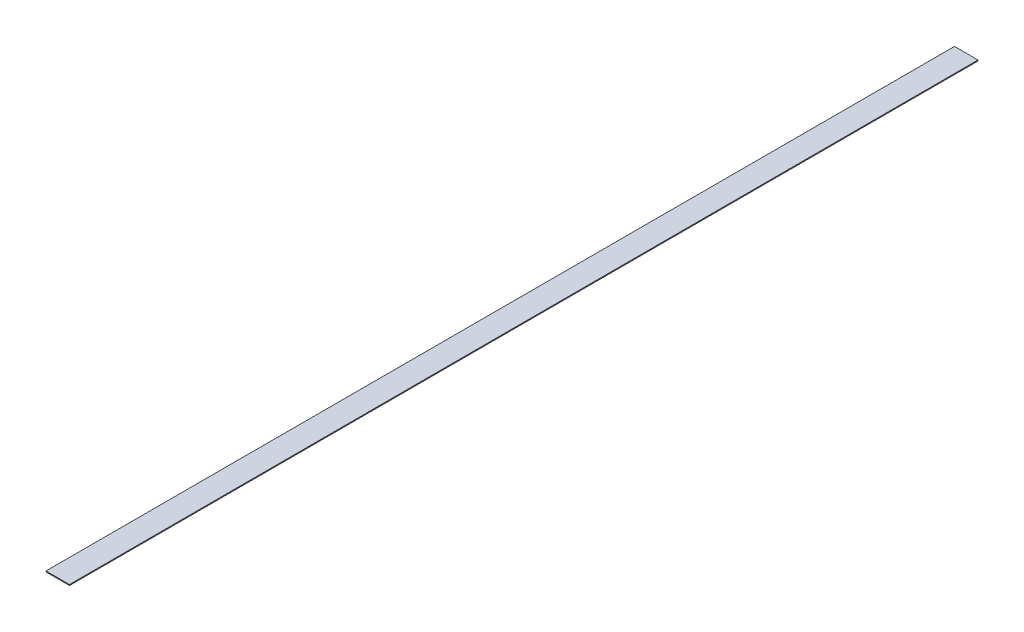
ISO-10303-21;
HEADER;
FILE_DESCRIPTION(('STEP AP214'),'2;1');
FILE_NAME('part.step','',(''),(''),'','','');
FILE_SCHEMA(('AUTOMOTIVE_DESIGN { 1 0 10303 214 1 1 1 1 }'));
ENDSEC;
DATA;
#1=APPLICATION_CONTEXT('core data for automotive mechanical design processes');
#2=APPLICATION_PROTOCOL_DEFINITION('international standard','automotive_design',2000,#1);
#3=PRODUCT_CONTEXT('',#1,'mechanical');
#4=PRODUCT('Part','Part','',(#3));
#5=PRODUCT_RELATED_PRODUCT_CATEGORY('part','',(#4));
#6=PRODUCT_DEFINITION_FORMATION('','',#4);
#7=PRODUCT_DEFINITION_CONTEXT('part definition',#1,'design');
#8=PRODUCT_DEFINITION('design','',#6,#7);
#9=PRODUCT_DEFINITION_SHAPE('','',#8);
#10=(LENGTH_UNIT() NAMED_UNIT(*) SI_UNIT(.MILLI.,.METRE.));
#11=(NAMED_UNIT(*) PLANE_ANGLE_UNIT() SI_UNIT($,.RADIAN.));
#12=(NAMED_UNIT(*) SI_UNIT($,.STERADIAN.) SOLID_ANGLE_UNIT());
#13=UNCERTAINTY_MEASURE_WITH_UNIT(LENGTH_MEASURE(1.E-05),#10,'distance_accuracy_value','');
#14=(GEOMETRIC_REPRESENTATION_CONTEXT(3) GLOBAL_UNCERTAINTY_ASSIGNED_CONTEXT((#13)) GLOBAL_UNIT_ASSIGNED_CONTEXT((#10,
#11,#12)) REPRESENTATION_CONTEXT('',''));
#15=CARTESIAN_POINT('',(0.,0.,0.));
#16=DIRECTION('',(0.,0.,1.));
#17=DIRECTION('',(1.,0.,0.));
#18=AXIS2_PLACEMENT_3D('',#15,#16,#17);
#19=CARTESIAN_POINT('',(0.,1.5,0.));
#20=DIRECTION('',(1.,0.,0.));
#21=DIRECTION('',(0.,0.,-1.));
#22=AXIS2_PLACEMENT_3D('',#19,#20,#21);
#23=PLANE('',#22);
#24=DIRECTION('',(0.,0.,1.));
#25=VECTOR('',#24,1.);
#26=CARTESIAN_POINT('',(0.,0.,0.));
#27=LINE('',#26,#25);
#28=CARTESIAN_POINT('',(0.,0.,-1470.));
#29=VERTEX_POINT('',#28);
#30=CARTESIAN_POINT('',(0.,0.,0.));
#31=VERTEX_POINT('',#30);
#32=EDGE_CURVE('E114',#29,#31,#27,.T.);
#33=ORIENTED_EDGE('',*,*,#32,.T.);
#34=DIRECTION('',(0.,-1.,0.));
#35=VECTOR('',#34,1.);
#36=CARTESIAN_POINT('',(0.,1.5,0.));
#37=LINE('',#36,#35);
#38=CARTESIAN_POINT('',(0.,1.5,0.));
#39=VERTEX_POINT('',#38);
#40=EDGE_CURVE('E11',#39,#31,#37,.T.);
#41=ORIENTED_EDGE('',*,*,#40,.F.);
#42=DIRECTION('',(0.,0.,1.));
#43=VECTOR('',#42,1.);
#44=CARTESIAN_POINT('',(0.,1.5,0.));
#45=LINE('',#44,#43);
#46=CARTESIAN_POINT('',(0.,1.5,-1470.));
#47=VERTEX_POINT('',#46);
#48=EDGE_CURVE('E98',#47,#39,#45,.T.);
#49=ORIENTED_EDGE('',*,*,#48,.F.);
#50=DIRECTION('',(0.,-1.,0.));
#51=VECTOR('',#50,1.);
#52=CARTESIAN_POINT('',(0.,1.5,-1470.));
#53=LINE('',#52,#51);
#54=EDGE_CURVE('E110',#47,#29,#53,.T.);
#55=ORIENTED_EDGE('',*,*,#54,.T.);
#56=EDGE_LOOP('',(#33,#41,#49,#55));
#57=FACE_BOUND('',#56,.T.);
#58=ADVANCED_FACE('F45',(#57),#23,.F.);
#59=CARTESIAN_POINT('',(0.,1.5,0.));
#60=DIRECTION('',(0.,0.,-1.));
#61=DIRECTION('',(-1.,0.,0.));
#62=AXIS2_PLACEMENT_3D('',#59,#60,#61);
#63=PLANE('',#62);
#64=DIRECTION('',(1.,0.,0.));
#65=VECTOR('',#64,1.);
#66=CARTESIAN_POINT('',(0.,0.,0.));
#67=LINE('',#66,#65);
#68=CARTESIAN_POINT('',(38.,0.,0.));
#69=VERTEX_POINT('',#68);
#70=EDGE_CURVE('E103',#31,#69,#67,.T.);
#71=ORIENTED_EDGE('',*,*,#70,.T.);
#72=DIRECTION('',(0.,-1.,0.));
#73=VECTOR('',#72,1.);
#74=CARTESIAN_POINT('',(38.,1.5,0.));
#75=LINE('',#74,#73);
#76=CARTESIAN_POINT('',(38.,1.5,0.));
#77=VERTEX_POINT('',#76);
#78=EDGE_CURVE('E53',#77,#69,#75,.T.);
#79=ORIENTED_EDGE('',*,*,#78,.F.);
#80=DIRECTION('',(1.,0.,0.));
#81=VECTOR('',#80,1.);
#82=CARTESIAN_POINT('',(0.,1.5,0.));
#83=LINE('',#82,#81);
#84=EDGE_CURVE('E92',#39,#77,#83,.T.);
#85=ORIENTED_EDGE('',*,*,#84,.F.);
#86=ORIENTED_EDGE('',*,*,#40,.T.);
#87=EDGE_LOOP('',(#71,#79,#85,#86));
#88=FACE_BOUND('',#87,.T.);
#89=ADVANCED_FACE('F102',(#88),#63,.F.);
#90=CARTESIAN_POINT('',(38.,1.5,0.));
#91=DIRECTION('',(-1.,0.,0.));
#92=DIRECTION('',(0.,0.,1.));
#93=AXIS2_PLACEMENT_3D('',#90,#91,#92);
#94=PLANE('',#93);
#95=DIRECTION('',(0.,0.,-1.));
#96=VECTOR('',#95,1.);
#97=CARTESIAN_POINT('',(38.,0.,0.));
#98=LINE('',#97,#96);
#99=CARTESIAN_POINT('',(38.,0.,-1470.));
#100=VERTEX_POINT('',#99);
#101=EDGE_CURVE('E79',#69,#100,#98,.T.);
#102=ORIENTED_EDGE('',*,*,#101,.T.);
#103=DIRECTION('',(0.,-1.,0.));
#104=VECTOR('',#103,1.);
#105=CARTESIAN_POINT('',(38.,1.5,-1470.));
#106=LINE('',#105,#104);
#107=CARTESIAN_POINT('',(38.,1.5,-1470.));
#108=VERTEX_POINT('',#107);
#109=EDGE_CURVE('E105',#108,#100,#106,.T.);
#110=ORIENTED_EDGE('',*,*,#109,.F.);
#111=DIRECTION('',(0.,0.,-1.));
#112=VECTOR('',#111,1.);
#113=CARTESIAN_POINT('',(38.,1.5,0.));
#114=LINE('',#113,#112);
#115=EDGE_CURVE('E96',#77,#108,#114,.T.);
#116=ORIENTED_EDGE('',*,*,#115,.F.);
#117=ORIENTED_EDGE('',*,*,#78,.T.);
#118=EDGE_LOOP('',(#102,#110,#116,#117));
#119=FACE_BOUND('',#118,.T.);
#120=ADVANCED_FACE('F106',(#119),#94,.F.);
#121=CARTESIAN_POINT('',(0.,1.5,-1470.));
#122=DIRECTION('',(0.,0.,1.));
#123=DIRECTION('',(1.,0.,0.));
#124=AXIS2_PLACEMENT_3D('',#121,#122,#123);
#125=PLANE('',#124);
#126=DIRECTION('',(-1.,0.,0.));
#127=VECTOR('',#126,1.);
#128=CARTESIAN_POINT('',(0.,0.,-1470.));
#129=LINE('',#128,#127);
#130=EDGE_CURVE('E85',#100,#29,#129,.T.);
#131=ORIENTED_EDGE('',*,*,#130,.T.);
#132=ORIENTED_EDGE('',*,*,#54,.F.);
#133=DIRECTION('',(-1.,0.,0.));
#134=VECTOR('',#133,1.);
#135=CARTESIAN_POINT('',(0.,1.5,-1470.));
#136=LINE('',#135,#134);
#137=EDGE_CURVE('E61',#108,#47,#136,.T.);
#138=ORIENTED_EDGE('',*,*,#137,.F.);
#139=ORIENTED_EDGE('',*,*,#109,.T.);
#140=EDGE_LOOP('',(#131,#132,#138,#139));
#141=FACE_BOUND('',#140,.T.);
#142=ADVANCED_FACE('F122',(#141),#125,.F.);
#143=CARTESIAN_POINT('',(0.,1.5,0.));
#144=DIRECTION('',(0.,-1.,0.));
#145=DIRECTION('',(0.,0.,-1.));
#146=AXIS2_PLACEMENT_3D('',#143,#144,#145);
#147=PLANE('',#146);
#148=ORIENTED_EDGE('',*,*,#48,.T.);
#149=ORIENTED_EDGE('',*,*,#84,.T.);
#150=ORIENTED_EDGE('',*,*,#115,.T.);
#151=ORIENTED_EDGE('',*,*,#137,.T.);
#152=EDGE_LOOP('',(#148,#149,#150,#151));
#153=FACE_BOUND('',#152,.T.);
#154=ADVANCED_FACE('F94',(#153),#147,.F.);
#155=CARTESIAN_POINT('',(0.,0.,0.));
#156=DIRECTION('',(0.,-1.,0.));
#157=DIRECTION('',(0.,0.,-1.));
#158=AXIS2_PLACEMENT_3D('',#155,#156,#157);
#159=PLANE('',#158);
#160=ORIENTED_EDGE('',*,*,#32,.F.);
#161=ORIENTED_EDGE('',*,*,#130,.F.);
#162=ORIENTED_EDGE('',*,*,#101,.F.);
#163=ORIENTED_EDGE('',*,*,#70,.F.);
#164=EDGE_LOOP('',(#160,#161,#162,#163));
#165=FACE_BOUND('',#164,.T.);
#166=ADVANCED_FACE('F125',(#165),#159,.T.);
#167=CLOSED_SHELL('',(#58,#89,#120,#142,#154,#166));
#168=MANIFOLD_SOLID_BREP('B2',#167);
#169=ADVANCED_BREP_SHAPE_REPRESENTATION('',(#18,#168),#14);
#170=SHAPE_DEFINITION_REPRESENTATION(#9,#169);
ENDSEC;
END-ISO-10303-21;
